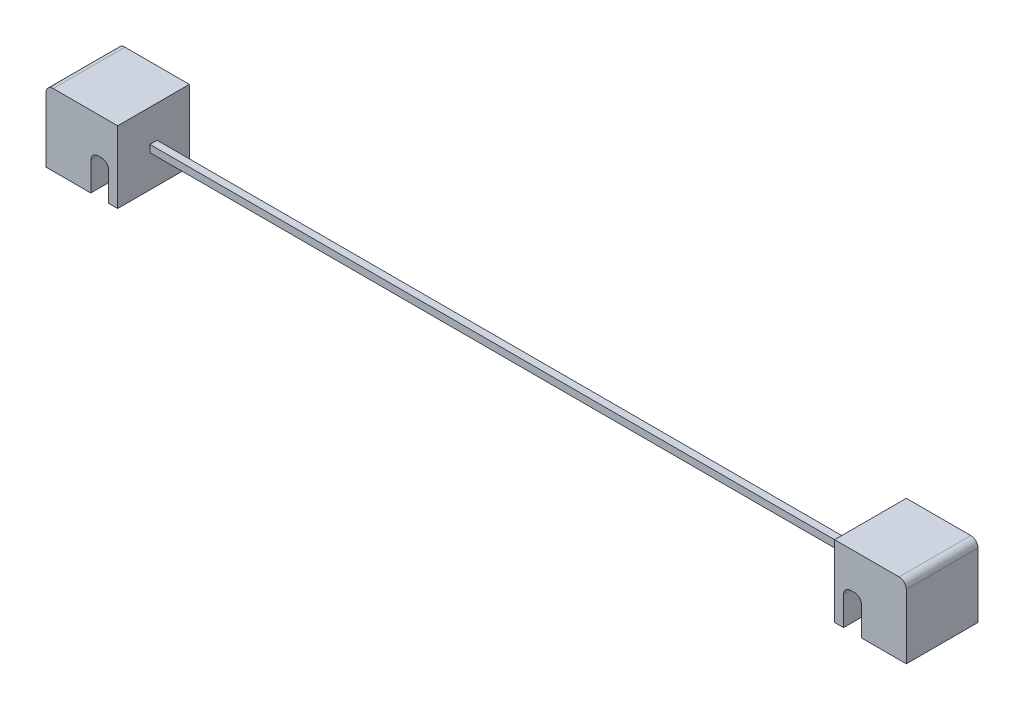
ISO-10303-21;
HEADER;
FILE_DESCRIPTION(('STEP AP214'),'2;1');
FILE_NAME('part.step','',(''),(''),'','','');
FILE_SCHEMA(('AUTOMOTIVE_DESIGN { 1 0 10303 214 1 1 1 1 }'));
ENDSEC;
DATA;
#1=APPLICATION_CONTEXT('core data for automotive mechanical design processes');
#2=APPLICATION_PROTOCOL_DEFINITION('international standard','automotive_design',2000,#1);
#3=PRODUCT_CONTEXT('',#1,'mechanical');
#4=PRODUCT('Part','Part','',(#3));
#5=PRODUCT_RELATED_PRODUCT_CATEGORY('part','',(#4));
#6=PRODUCT_DEFINITION_FORMATION('','',#4);
#7=PRODUCT_DEFINITION_CONTEXT('part definition',#1,'design');
#8=PRODUCT_DEFINITION('design','',#6,#7);
#9=PRODUCT_DEFINITION_SHAPE('','',#8);
#10=(LENGTH_UNIT() NAMED_UNIT(*) SI_UNIT(.MILLI.,.METRE.));
#11=(NAMED_UNIT(*) PLANE_ANGLE_UNIT() SI_UNIT($,.RADIAN.));
#12=(NAMED_UNIT(*) SI_UNIT($,.STERADIAN.) SOLID_ANGLE_UNIT());
#13=UNCERTAINTY_MEASURE_WITH_UNIT(LENGTH_MEASURE(1.E-05),#10,'distance_accuracy_value','');
#14=(GEOMETRIC_REPRESENTATION_CONTEXT(3) GLOBAL_UNCERTAINTY_ASSIGNED_CONTEXT((#13)) GLOBAL_UNIT_ASSIGNED_CONTEXT((#10,
#11,#12)) REPRESENTATION_CONTEXT('',''));
#15=CARTESIAN_POINT('',(0.,0.,0.));
#16=DIRECTION('',(0.,0.,1.));
#17=DIRECTION('',(1.,0.,0.));
#18=AXIS2_PLACEMENT_3D('',#15,#16,#17);
#19=CARTESIAN_POINT('',(-71.4285714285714,0.,142.857142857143));
#20=DIRECTION('',(-1.,0.,0.));
#21=DIRECTION('',(0.,0.,1.));
#22=AXIS2_PLACEMENT_3D('',#19,#20,#21);
#23=PLANE('',#22);
#24=DIRECTION('',(0.,1.,0.));
#25=VECTOR('',#24,1.);
#26=CARTESIAN_POINT('',(-71.4285714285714,0.,0.));
#27=LINE('',#26,#25);
#28=CARTESIAN_POINT('',(-71.4285714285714,-71.4285714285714,0.));
#29=VERTEX_POINT('',#28);
#30=CARTESIAN_POINT('',(-71.4285714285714,71.4285714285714,0.));
#31=VERTEX_POINT('',#30);
#32=EDGE_CURVE('E207',#29,#31,#27,.T.);
#33=ORIENTED_EDGE('',*,*,#32,.F.);
#34=DIRECTION('',(0.,0.,-1.));
#35=VECTOR('',#34,1.);
#36=CARTESIAN_POINT('',(-71.4285714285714,-71.4285714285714,142.857142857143));
#37=LINE('',#36,#35);
#38=CARTESIAN_POINT('',(-71.4285714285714,-71.4285714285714,142.857142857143));
#39=VERTEX_POINT('',#38);
#40=EDGE_CURVE('E165',#39,#29,#37,.T.);
#41=ORIENTED_EDGE('',*,*,#40,.F.);
#42=DIRECTION('',(0.,1.,0.));
#43=VECTOR('',#42,1.);
#44=CARTESIAN_POINT('',(-71.4285714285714,0.,142.857142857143));
#45=LINE('',#44,#43);
#46=CARTESIAN_POINT('',(-71.4285714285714,71.4285714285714,142.857142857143));
#47=VERTEX_POINT('',#46);
#48=EDGE_CURVE('E147',#39,#47,#45,.T.);
#49=ORIENTED_EDGE('',*,*,#48,.T.);
#50=DIRECTION('',(0.,0.,-1.));
#51=VECTOR('',#50,1.);
#52=CARTESIAN_POINT('',(-71.4285714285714,71.4285714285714,142.857142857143));
#53=LINE('',#52,#51);
#54=EDGE_CURVE('E156',#47,#31,#53,.T.);
#55=ORIENTED_EDGE('',*,*,#54,.T.);
#56=EDGE_LOOP('',(#33,#41,#49,#55));
#57=FACE_BOUND('',#56,.T.);
#58=DIRECTION('',(0.,0.,1.));
#59=VECTOR('',#58,1.);
#60=CARTESIAN_POINT('',(-71.4285714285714,-7.14285714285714,78.5714285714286));
#61=LINE('',#60,#59);
#62=CARTESIAN_POINT('',(-71.4285714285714,-7.14285714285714,64.2857142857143));
#63=VERTEX_POINT('',#62);
#64=CARTESIAN_POINT('',(-71.4285714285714,-7.14285714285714,78.5714285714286));
#65=VERTEX_POINT('',#64);
#66=EDGE_CURVE('E303',#63,#65,#61,.T.);
#67=ORIENTED_EDGE('',*,*,#66,.F.);
#68=DIRECTION('',(0.,-1.,0.));
#69=VECTOR('',#68,1.);
#70=CARTESIAN_POINT('',(-71.4285714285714,-7.14285714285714,64.2857142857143));
#71=LINE('',#70,#69);
#72=CARTESIAN_POINT('',(-71.4285714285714,7.14285714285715,64.2857142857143));
#73=VERTEX_POINT('',#72);
#74=EDGE_CURVE('E307',#73,#63,#71,.T.);
#75=ORIENTED_EDGE('',*,*,#74,.F.);
#76=DIRECTION('',(0.,0.,-1.));
#77=VECTOR('',#76,1.);
#78=CARTESIAN_POINT('',(-71.4285714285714,7.14285714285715,78.5714285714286));
#79=LINE('',#78,#77);
#80=CARTESIAN_POINT('',(-71.4285714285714,7.14285714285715,78.5714285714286));
#81=VERTEX_POINT('',#80);
#82=EDGE_CURVE('E296',#81,#73,#79,.T.);
#83=ORIENTED_EDGE('',*,*,#82,.F.);
#84=DIRECTION('',(0.,1.,0.));
#85=VECTOR('',#84,1.);
#86=CARTESIAN_POINT('',(-71.4285714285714,-7.14285714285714,78.5714285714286));
#87=LINE('',#86,#85);
#88=EDGE_CURVE('E300',#65,#81,#87,.T.);
#89=ORIENTED_EDGE('',*,*,#88,.F.);
#90=EDGE_LOOP('',(#67,#75,#83,#89));
#91=FACE_BOUND('',#90,.T.);
#92=ADVANCED_FACE('F41',(#57,#91),#23,.T.);
#93=CARTESIAN_POINT('',(-53.5714285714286,0.,142.857142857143));
#94=DIRECTION('',(-1.,0.,0.));
#95=DIRECTION('',(0.,-1.,0.));
#96=AXIS2_PLACEMENT_3D('',#93,#94,#95);
#97=PLANE('',#96);
#98=DIRECTION('',(0.,1.,0.));
#99=VECTOR('',#98,1.);
#100=CARTESIAN_POINT('',(-53.5714285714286,0.,0.));
#101=LINE('',#100,#99);
#102=CARTESIAN_POINT('',(-53.5714285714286,-71.4285714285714,0.));
#103=VERTEX_POINT('',#102);
#104=CARTESIAN_POINT('',(-53.5714285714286,-14.2857142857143,0.));
#105=VERTEX_POINT('',#104);
#106=EDGE_CURVE('E176',#103,#105,#101,.T.);
#107=ORIENTED_EDGE('',*,*,#106,.T.);
#108=DIRECTION('',(0.,0.,-1.));
#109=VECTOR('',#108,1.);
#110=CARTESIAN_POINT('',(-53.5714285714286,-14.2857142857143,142.857142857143));
#111=LINE('',#110,#109);
#112=CARTESIAN_POINT('',(-53.5714285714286,-14.2857142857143,142.857142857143));
#113=VERTEX_POINT('',#112);
#114=EDGE_CURVE('E11',#113,#105,#111,.T.);
#115=ORIENTED_EDGE('',*,*,#114,.F.);
#116=DIRECTION('',(0.,1.,0.));
#117=VECTOR('',#116,1.);
#118=CARTESIAN_POINT('',(-53.5714285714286,0.,142.857142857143));
#119=LINE('',#118,#117);
#120=CARTESIAN_POINT('',(-53.5714285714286,-71.4285714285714,142.857142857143));
#121=VERTEX_POINT('',#120);
#122=EDGE_CURVE('E276',#121,#113,#119,.T.);
#123=ORIENTED_EDGE('',*,*,#122,.F.);
#124=DIRECTION('',(0.,0.,-1.));
#125=VECTOR('',#124,1.);
#126=CARTESIAN_POINT('',(-53.5714285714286,-71.4285714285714,142.857142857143));
#127=LINE('',#126,#125);
#128=EDGE_CURVE('E66',#121,#103,#127,.T.);
#129=ORIENTED_EDGE('',*,*,#128,.T.);
#130=EDGE_LOOP('',(#107,#115,#123,#129));
#131=FACE_BOUND('',#130,.T.);
#132=ADVANCED_FACE('F43',(#131),#97,.F.);
#133=CARTESIAN_POINT('',(-39.2857142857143,-14.2857142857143,142.857142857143));
#134=DIRECTION('',(0.,0.,-1.));
#135=DIRECTION('',(-1.,0.,0.));
#136=AXIS2_PLACEMENT_3D('',#133,#134,#135);
#137=CYLINDRICAL_SURFACE('',#136,14.2857142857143);
#138=CARTESIAN_POINT('',(-39.2857142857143,-14.2857142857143,0.));
#139=DIRECTION('',(0.,0.,1.));
#140=DIRECTION('',(1.,0.,0.));
#141=AXIS2_PLACEMENT_3D('',#138,#139,#140);
#142=CIRCLE('',#141,14.2857142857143);
#143=CARTESIAN_POINT('',(-39.2857142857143,0.,0.));
#144=VERTEX_POINT('',#143);
#145=EDGE_CURVE('E179',#105,#144,#142,.F.);
#146=ORIENTED_EDGE('',*,*,#145,.T.);
#147=DIRECTION('',(0.,0.,-1.));
#148=VECTOR('',#147,1.);
#149=CARTESIAN_POINT('',(-39.2857142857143,0.,142.857142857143));
#150=LINE('',#149,#148);
#151=CARTESIAN_POINT('',(-39.2857142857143,0.,142.857142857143));
#152=VERTEX_POINT('',#151);
#153=EDGE_CURVE('E50',#152,#144,#150,.T.);
#154=ORIENTED_EDGE('',*,*,#153,.F.);
#155=CARTESIAN_POINT('',(-39.2857142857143,-14.2857142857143,142.857142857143));
#156=DIRECTION('',(0.,0.,1.));
#157=DIRECTION('',(1.,0.,0.));
#158=AXIS2_PLACEMENT_3D('',#155,#156,#157);
#159=CIRCLE('',#158,14.2857142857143);
#160=EDGE_CURVE('E114',#113,#152,#159,.F.);
#161=ORIENTED_EDGE('',*,*,#160,.F.);
#162=ORIENTED_EDGE('',*,*,#114,.T.);
#163=EDGE_LOOP('',(#146,#154,#161,#162));
#164=FACE_BOUND('',#163,.T.);
#165=ADVANCED_FACE('F546',(#164),#137,.F.);
#166=CARTESIAN_POINT('',(0.,0.,142.857142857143));
#167=DIRECTION('',(0.,1.,0.));
#168=DIRECTION('',(-1.,0.,0.));
#169=AXIS2_PLACEMENT_3D('',#166,#167,#168);
#170=PLANE('',#169);
#171=DIRECTION('',(1.,0.,0.));
#172=VECTOR('',#171,1.);
#173=CARTESIAN_POINT('',(0.,0.,0.));
#174=LINE('',#173,#172);
#175=CARTESIAN_POINT('',(-32.1428571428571,0.,0.));
#176=VERTEX_POINT('',#175);
#177=EDGE_CURVE('E183',#144,#176,#174,.T.);
#178=ORIENTED_EDGE('',*,*,#177,.T.);
#179=DIRECTION('',(0.,0.,-1.));
#180=VECTOR('',#179,1.);
#181=CARTESIAN_POINT('',(-32.1428571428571,0.,142.857142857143));
#182=LINE('',#181,#180);
#183=CARTESIAN_POINT('',(-32.1428571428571,0.,142.857142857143));
#184=VERTEX_POINT('',#183);
#185=EDGE_CURVE('E229',#184,#176,#182,.T.);
#186=ORIENTED_EDGE('',*,*,#185,.F.);
#187=DIRECTION('',(1.,0.,0.));
#188=VECTOR('',#187,1.);
#189=CARTESIAN_POINT('',(0.,0.,142.857142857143));
#190=LINE('',#189,#188);
#191=EDGE_CURVE('E239',#152,#184,#190,.T.);
#192=ORIENTED_EDGE('',*,*,#191,.F.);
#193=ORIENTED_EDGE('',*,*,#153,.T.);
#194=EDGE_LOOP('',(#178,#186,#192,#193));
#195=FACE_BOUND('',#194,.T.);
#196=ADVANCED_FACE('F237',(#195),#170,.F.);
#197=CARTESIAN_POINT('',(-32.1428571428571,-14.2857142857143,142.857142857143));
#198=DIRECTION('',(0.,0.,-1.));
#199=DIRECTION('',(-1.,0.,0.));
#200=AXIS2_PLACEMENT_3D('',#197,#198,#199);
#201=CYLINDRICAL_SURFACE('',#200,14.2857142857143);
#202=CARTESIAN_POINT('',(-32.1428571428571,-14.2857142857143,0.));
#203=DIRECTION('',(0.,0.,1.));
#204=DIRECTION('',(1.,0.,0.));
#205=AXIS2_PLACEMENT_3D('',#202,#203,#204);
#206=CIRCLE('',#205,14.2857142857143);
#207=CARTESIAN_POINT('',(-17.8571428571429,-14.2857142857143,0.));
#208=VERTEX_POINT('',#207);
#209=EDGE_CURVE('E186',#176,#208,#206,.F.);
#210=ORIENTED_EDGE('',*,*,#209,.T.);
#211=DIRECTION('',(0.,0.,-1.));
#212=VECTOR('',#211,1.);
#213=CARTESIAN_POINT('',(-17.8571428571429,-14.2857142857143,142.857142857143));
#214=LINE('',#213,#212);
#215=CARTESIAN_POINT('',(-17.8571428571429,-14.2857142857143,142.857142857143));
#216=VERTEX_POINT('',#215);
#217=EDGE_CURVE('E226',#216,#208,#214,.T.);
#218=ORIENTED_EDGE('',*,*,#217,.F.);
#219=CARTESIAN_POINT('',(-32.1428571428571,-14.2857142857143,142.857142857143));
#220=DIRECTION('',(0.,0.,1.));
#221=DIRECTION('',(1.,0.,0.));
#222=AXIS2_PLACEMENT_3D('',#219,#220,#221);
#223=CIRCLE('',#222,14.2857142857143);
#224=EDGE_CURVE('E249',#184,#216,#223,.F.);
#225=ORIENTED_EDGE('',*,*,#224,.F.);
#226=ORIENTED_EDGE('',*,*,#185,.T.);
#227=EDGE_LOOP('',(#210,#218,#225,#226));
#228=FACE_BOUND('',#227,.T.);
#229=ADVANCED_FACE('F246',(#228),#201,.F.);
#230=CARTESIAN_POINT('',(-17.8571428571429,0.,142.857142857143));
#231=DIRECTION('',(-1.,0.,0.));
#232=DIRECTION('',(0.,0.,1.));
#233=AXIS2_PLACEMENT_3D('',#230,#231,#232);
#234=PLANE('',#233);
#235=DIRECTION('',(0.,1.,0.));
#236=VECTOR('',#235,1.);
#237=CARTESIAN_POINT('',(-17.8571428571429,0.,0.));
#238=LINE('',#237,#236);
#239=CARTESIAN_POINT('',(-17.8571428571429,-71.4285714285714,0.));
#240=VERTEX_POINT('',#239);
#241=EDGE_CURVE('E190',#240,#208,#238,.T.);
#242=ORIENTED_EDGE('',*,*,#241,.F.);
#243=DIRECTION('',(0.,0.,-1.));
#244=VECTOR('',#243,1.);
#245=CARTESIAN_POINT('',(-17.8571428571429,-71.4285714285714,142.857142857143));
#246=LINE('',#245,#244);
#247=CARTESIAN_POINT('',(-17.8571428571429,-71.4285714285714,142.857142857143));
#248=VERTEX_POINT('',#247);
#249=EDGE_CURVE('E223',#248,#240,#246,.T.);
#250=ORIENTED_EDGE('',*,*,#249,.F.);
#251=DIRECTION('',(0.,1.,0.));
#252=VECTOR('',#251,1.);
#253=CARTESIAN_POINT('',(-17.8571428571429,0.,142.857142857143));
#254=LINE('',#253,#252);
#255=EDGE_CURVE('E252',#248,#216,#254,.T.);
#256=ORIENTED_EDGE('',*,*,#255,.T.);
#257=ORIENTED_EDGE('',*,*,#217,.T.);
#258=EDGE_LOOP('',(#242,#250,#256,#257));
#259=FACE_BOUND('',#258,.T.);
#260=ADVANCED_FACE('F558',(#259),#234,.T.);
#261=CARTESIAN_POINT('',(0.,-71.4285714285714,142.857142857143));
#262=DIRECTION('',(0.,-1.,0.));
#263=DIRECTION('',(1.,0.,0.));
#264=AXIS2_PLACEMENT_3D('',#261,#262,#263);
#265=PLANE('',#264);
#266=DIRECTION('',(-1.,0.,0.));
#267=VECTOR('',#266,1.);
#268=CARTESIAN_POINT('',(0.,-71.4285714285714,0.));
#269=LINE('',#268,#267);
#270=CARTESIAN_POINT('',(71.4285714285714,-71.4285714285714,0.));
#271=VERTEX_POINT('',#270);
#272=EDGE_CURVE('E194',#271,#240,#269,.T.);
#273=ORIENTED_EDGE('',*,*,#272,.F.);
#274=DIRECTION('',(0.,0.,-1.));
#275=VECTOR('',#274,1.);
#276=CARTESIAN_POINT('',(71.4285714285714,-71.4285714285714,142.857142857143));
#277=LINE('',#276,#275);
#278=CARTESIAN_POINT('',(71.4285714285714,-71.4285714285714,142.857142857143));
#279=VERTEX_POINT('',#278);
#280=EDGE_CURVE('E220',#279,#271,#277,.T.);
#281=ORIENTED_EDGE('',*,*,#280,.F.);
#282=DIRECTION('',(-1.,0.,0.));
#283=VECTOR('',#282,1.);
#284=CARTESIAN_POINT('',(0.,-71.4285714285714,142.857142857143));
#285=LINE('',#284,#283);
#286=EDGE_CURVE('E173',#279,#248,#285,.T.);
#287=ORIENTED_EDGE('',*,*,#286,.T.);
#288=ORIENTED_EDGE('',*,*,#249,.T.);
#289=EDGE_LOOP('',(#273,#281,#287,#288));
#290=FACE_BOUND('',#289,.T.);
#291=ADVANCED_FACE('F557',(#290),#265,.T.);
#292=CARTESIAN_POINT('',(71.4285714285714,0.,142.857142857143));
#293=DIRECTION('',(-1.,0.,0.));
#294=DIRECTION('',(0.,0.,1.));
#295=AXIS2_PLACEMENT_3D('',#292,#293,#294);
#296=PLANE('',#295);
#297=DIRECTION('',(0.,1.,0.));
#298=VECTOR('',#297,1.);
#299=CARTESIAN_POINT('',(71.4285714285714,0.,0.));
#300=LINE('',#299,#298);
#301=CARTESIAN_POINT('',(71.4285714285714,57.1428571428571,0.));
#302=VERTEX_POINT('',#301);
#303=EDGE_CURVE('E198',#271,#302,#300,.T.);
#304=ORIENTED_EDGE('',*,*,#303,.T.);
#305=DIRECTION('',(0.,0.,-1.));
#306=VECTOR('',#305,1.);
#307=CARTESIAN_POINT('',(71.4285714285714,57.1428571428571,142.857142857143));
#308=LINE('',#307,#306);
#309=CARTESIAN_POINT('',(71.4285714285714,57.1428571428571,142.857142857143));
#310=VERTEX_POINT('',#309);
#311=EDGE_CURVE('E216',#310,#302,#308,.T.);
#312=ORIENTED_EDGE('',*,*,#311,.F.);
#313=DIRECTION('',(0.,1.,0.));
#314=VECTOR('',#313,1.);
#315=CARTESIAN_POINT('',(71.4285714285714,0.,142.857142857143));
#316=LINE('',#315,#314);
#317=EDGE_CURVE('E262',#279,#310,#316,.T.);
#318=ORIENTED_EDGE('',*,*,#317,.F.);
#319=ORIENTED_EDGE('',*,*,#280,.T.);
#320=EDGE_LOOP('',(#304,#312,#318,#319));
#321=FACE_BOUND('',#320,.T.);
#322=ADVANCED_FACE('F269',(#321),#296,.F.);
#323=CARTESIAN_POINT('',(57.1428571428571,57.1428571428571,142.857142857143));
#324=DIRECTION('',(0.,0.,-1.));
#325=DIRECTION('',(-1.,0.,0.));
#326=AXIS2_PLACEMENT_3D('',#323,#324,#325);
#327=CYLINDRICAL_SURFACE('',#326,14.2857142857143);
#328=CARTESIAN_POINT('',(57.1428571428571,57.1428571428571,0.));
#329=DIRECTION('',(0.,0.,1.));
#330=DIRECTION('',(1.,0.,0.));
#331=AXIS2_PLACEMENT_3D('',#328,#329,#330);
#332=CIRCLE('',#331,14.2857142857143);
#333=CARTESIAN_POINT('',(57.1428571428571,71.4285714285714,0.));
#334=VERTEX_POINT('',#333);
#335=EDGE_CURVE('E202',#302,#334,#332,.T.);
#336=ORIENTED_EDGE('',*,*,#335,.T.);
#337=DIRECTION('',(0.,0.,-1.));
#338=VECTOR('',#337,1.);
#339=CARTESIAN_POINT('',(57.1428571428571,71.4285714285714,142.857142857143));
#340=LINE('',#339,#338);
#341=CARTESIAN_POINT('',(57.1428571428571,71.4285714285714,142.857142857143));
#342=VERTEX_POINT('',#341);
#343=EDGE_CURVE('E164',#342,#334,#340,.T.);
#344=ORIENTED_EDGE('',*,*,#343,.F.);
#345=CARTESIAN_POINT('',(57.1428571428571,57.1428571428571,142.857142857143));
#346=DIRECTION('',(0.,0.,1.));
#347=DIRECTION('',(1.,0.,0.));
#348=AXIS2_PLACEMENT_3D('',#345,#346,#347);
#349=CIRCLE('',#348,14.2857142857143);
#350=EDGE_CURVE('E149',#310,#342,#349,.T.);
#351=ORIENTED_EDGE('',*,*,#350,.F.);
#352=ORIENTED_EDGE('',*,*,#311,.T.);
#353=EDGE_LOOP('',(#336,#344,#351,#352));
#354=FACE_BOUND('',#353,.T.);
#355=ADVANCED_FACE('F273',(#354),#327,.T.);
#356=CARTESIAN_POINT('',(0.,71.4285714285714,142.857142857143));
#357=DIRECTION('',(0.,-1.,0.));
#358=DIRECTION('',(1.,0.,0.));
#359=AXIS2_PLACEMENT_3D('',#356,#357,#358);
#360=PLANE('',#359);
#361=DIRECTION('',(-1.,0.,0.));
#362=VECTOR('',#361,1.);
#363=CARTESIAN_POINT('',(0.,71.4285714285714,0.));
#364=LINE('',#363,#362);
#365=EDGE_CURVE('E159',#334,#31,#364,.T.);
#366=ORIENTED_EDGE('',*,*,#365,.T.);
#367=ORIENTED_EDGE('',*,*,#54,.F.);
#368=DIRECTION('',(-1.,0.,0.));
#369=VECTOR('',#368,1.);
#370=CARTESIAN_POINT('',(0.,71.4285714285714,142.857142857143));
#371=LINE('',#370,#369);
#372=EDGE_CURVE('E142',#342,#47,#371,.T.);
#373=ORIENTED_EDGE('',*,*,#372,.F.);
#374=ORIENTED_EDGE('',*,*,#343,.T.);
#375=EDGE_LOOP('',(#366,#367,#373,#374));
#376=FACE_BOUND('',#375,.T.);
#377=ADVANCED_FACE('F157',(#376),#360,.F.);
#378=EDGE_CURVE('E199',#103,#29,#269,.T.);
#379=ORIENTED_EDGE('',*,*,#378,.F.);
#380=ORIENTED_EDGE('',*,*,#128,.F.);
#381=EDGE_CURVE('E169',#121,#39,#285,.T.);
#382=ORIENTED_EDGE('',*,*,#381,.T.);
#383=ORIENTED_EDGE('',*,*,#40,.T.);
#384=EDGE_LOOP('',(#379,#380,#382,#383));
#385=FACE_BOUND('',#384,.T.);
#386=ADVANCED_FACE('F549',(#385),#265,.T.);
#387=CARTESIAN_POINT('',(0.,0.,142.857142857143));
#388=DIRECTION('',(0.,0.,1.));
#389=DIRECTION('',(1.,0.,0.));
#390=AXIS2_PLACEMENT_3D('',#387,#388,#389);
#391=PLANE('',#390);
#392=ORIENTED_EDGE('',*,*,#122,.T.);
#393=ORIENTED_EDGE('',*,*,#160,.T.);
#394=ORIENTED_EDGE('',*,*,#191,.T.);
#395=ORIENTED_EDGE('',*,*,#224,.T.);
#396=ORIENTED_EDGE('',*,*,#255,.F.);
#397=ORIENTED_EDGE('',*,*,#286,.F.);
#398=ORIENTED_EDGE('',*,*,#317,.T.);
#399=ORIENTED_EDGE('',*,*,#350,.T.);
#400=ORIENTED_EDGE('',*,*,#372,.T.);
#401=ORIENTED_EDGE('',*,*,#48,.F.);
#402=ORIENTED_EDGE('',*,*,#381,.F.);
#403=EDGE_LOOP('',(#392,#393,#394,#395,#396,#397,#398,#399,#400,#401,#402));
#404=FACE_BOUND('',#403,.T.);
#405=ADVANCED_FACE('F144',(#404),#391,.T.);
#406=CARTESIAN_POINT('',(0.,0.,0.));
#407=DIRECTION('',(0.,0.,1.));
#408=DIRECTION('',(1.,0.,0.));
#409=AXIS2_PLACEMENT_3D('',#406,#407,#408);
#410=PLANE('',#409);
#411=ORIENTED_EDGE('',*,*,#106,.F.);
#412=ORIENTED_EDGE('',*,*,#378,.T.);
#413=ORIENTED_EDGE('',*,*,#32,.T.);
#414=ORIENTED_EDGE('',*,*,#365,.F.);
#415=ORIENTED_EDGE('',*,*,#335,.F.);
#416=ORIENTED_EDGE('',*,*,#303,.F.);
#417=ORIENTED_EDGE('',*,*,#272,.T.);
#418=ORIENTED_EDGE('',*,*,#241,.T.);
#419=ORIENTED_EDGE('',*,*,#209,.F.);
#420=ORIENTED_EDGE('',*,*,#177,.F.);
#421=ORIENTED_EDGE('',*,*,#145,.F.);
#422=EDGE_LOOP('',(#411,#412,#413,#414,#415,#416,#417,#418,#419,#420,#421));
#423=FACE_BOUND('',#422,.T.);
#424=ADVANCED_FACE('F242',(#423),#410,.F.);
#425=CARTESIAN_POINT('',(-1500.,-7.14285714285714,64.2857142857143));
#426=DIRECTION('',(0.,0.,1.));
#427=DIRECTION('',(1.,0.,0.));
#428=AXIS2_PLACEMENT_3D('',#425,#426,#427);
#429=PLANE('',#428);
#430=ORIENTED_EDGE('',*,*,#74,.T.);
#431=DIRECTION('',(1.,0.,0.));
#432=VECTOR('',#431,1.);
#433=CARTESIAN_POINT('',(-1500.,-7.14285714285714,64.2857142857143));
#434=LINE('',#433,#432);
#435=CARTESIAN_POINT('',(-1500.,-7.14285714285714,64.2857142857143));
#436=VERTEX_POINT('',#435);
#437=EDGE_CURVE('E180',#436,#63,#434,.T.);
#438=ORIENTED_EDGE('',*,*,#437,.F.);
#439=DIRECTION('',(0.,-1.,0.));
#440=VECTOR('',#439,1.);
#441=CARTESIAN_POINT('',(-1500.,-7.14285714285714,64.2857142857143));
#442=LINE('',#441,#440);
#443=CARTESIAN_POINT('',(-1500.,7.14285714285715,64.2857142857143));
#444=VERTEX_POINT('',#443);
#445=EDGE_CURVE('E299',#444,#436,#442,.T.);
#446=ORIENTED_EDGE('',*,*,#445,.F.);
#447=DIRECTION('',(1.,0.,0.));
#448=VECTOR('',#447,1.);
#449=CARTESIAN_POINT('',(-1500.,7.14285714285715,64.2857142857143));
#450=LINE('',#449,#448);
#451=EDGE_CURVE('E291',#444,#73,#450,.T.);
#452=ORIENTED_EDGE('',*,*,#451,.T.);
#453=EDGE_LOOP('',(#430,#438,#446,#452));
#454=FACE_BOUND('',#453,.T.);
#455=ADVANCED_FACE('F522',(#454),#429,.F.);
#456=CARTESIAN_POINT('',(-1500.,-7.14285714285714,78.5714285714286));
#457=DIRECTION('',(0.,1.,0.));
#458=DIRECTION('',(0.,0.,1.));
#459=AXIS2_PLACEMENT_3D('',#456,#457,#458);
#460=PLANE('',#459);
#461=ORIENTED_EDGE('',*,*,#66,.T.);
#462=DIRECTION('',(1.,0.,0.));
#463=VECTOR('',#462,1.);
#464=CARTESIAN_POINT('',(-1500.,-7.14285714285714,78.5714285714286));
#465=LINE('',#464,#463);
#466=CARTESIAN_POINT('',(-1500.,-7.14285714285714,78.5714285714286));
#467=VERTEX_POINT('',#466);
#468=EDGE_CURVE('E285',#467,#65,#465,.T.);
#469=ORIENTED_EDGE('',*,*,#468,.F.);
#470=DIRECTION('',(0.,0.,1.));
#471=VECTOR('',#470,1.);
#472=CARTESIAN_POINT('',(-1500.,-7.14285714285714,78.5714285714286));
#473=LINE('',#472,#471);
#474=EDGE_CURVE('E319',#436,#467,#473,.T.);
#475=ORIENTED_EDGE('',*,*,#474,.F.);
#476=ORIENTED_EDGE('',*,*,#437,.T.);
#477=EDGE_LOOP('',(#461,#469,#475,#476));
#478=FACE_BOUND('',#477,.T.);
#479=ADVANCED_FACE('F527',(#478),#460,.F.);
#480=CARTESIAN_POINT('',(-1500.,-7.14285714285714,78.5714285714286));
#481=DIRECTION('',(0.,0.,-1.));
#482=DIRECTION('',(-1.,0.,0.));
#483=AXIS2_PLACEMENT_3D('',#480,#481,#482);
#484=PLANE('',#483);
#485=ORIENTED_EDGE('',*,*,#88,.T.);
#486=DIRECTION('',(1.,0.,0.));
#487=VECTOR('',#486,1.);
#488=CARTESIAN_POINT('',(-1500.,7.14285714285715,78.5714285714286));
#489=LINE('',#488,#487);
#490=CARTESIAN_POINT('',(-1500.,7.14285714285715,78.5714285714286));
#491=VERTEX_POINT('',#490);
#492=EDGE_CURVE('E57',#491,#81,#489,.T.);
#493=ORIENTED_EDGE('',*,*,#492,.F.);
#494=DIRECTION('',(0.,1.,0.));
#495=VECTOR('',#494,1.);
#496=CARTESIAN_POINT('',(-1500.,-7.14285714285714,78.5714285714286));
#497=LINE('',#496,#495);
#498=EDGE_CURVE('E315',#467,#491,#497,.T.);
#499=ORIENTED_EDGE('',*,*,#498,.F.);
#500=ORIENTED_EDGE('',*,*,#468,.T.);
#501=EDGE_LOOP('',(#485,#493,#499,#500));
#502=FACE_BOUND('',#501,.T.);
#503=ADVANCED_FACE('F525',(#502),#484,.F.);
#504=CARTESIAN_POINT('',(-1500.,7.14285714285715,78.5714285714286));
#505=DIRECTION('',(0.,-1.,0.));
#506=DIRECTION('',(0.,0.,-1.));
#507=AXIS2_PLACEMENT_3D('',#504,#505,#506);
#508=PLANE('',#507);
#509=ORIENTED_EDGE('',*,*,#82,.T.);
#510=ORIENTED_EDGE('',*,*,#451,.F.);
#511=DIRECTION('',(0.,0.,-1.));
#512=VECTOR('',#511,1.);
#513=CARTESIAN_POINT('',(-1500.,7.14285714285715,78.5714285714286));
#514=LINE('',#513,#512);
#515=EDGE_CURVE('E295',#491,#444,#514,.T.);
#516=ORIENTED_EDGE('',*,*,#515,.F.);
#517=ORIENTED_EDGE('',*,*,#492,.T.);
#518=EDGE_LOOP('',(#509,#510,#516,#517));
#519=FACE_BOUND('',#518,.T.);
#520=ADVANCED_FACE('F518',(#519),#508,.F.);
#521=CARTESIAN_POINT('',(-1499.99999142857,0.,142.857142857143));
#522=DIRECTION('',(-1.,0.,0.));
#523=DIRECTION('',(0.,0.,1.));
#524=AXIS2_PLACEMENT_3D('',#521,#522,#523);
#525=PLANE('',#524);
#526=DIRECTION('',(0.,1.,0.));
#527=VECTOR('',#526,1.);
#528=CARTESIAN_POINT('',(-1499.99999142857,0.,0.));
#529=LINE('',#528,#527);
#530=CARTESIAN_POINT('',(-1499.99999142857,-71.4285714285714,0.));
#531=VERTEX_POINT('',#530);
#532=CARTESIAN_POINT('',(-1499.99999142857,71.4285714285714,0.));
#533=VERTEX_POINT('',#532);
#534=EDGE_CURVE('E400',#531,#533,#529,.T.);
#535=ORIENTED_EDGE('',*,*,#534,.T.);
#536=DIRECTION('',(0.,0.,-1.));
#537=VECTOR('',#536,1.);
#538=CARTESIAN_POINT('',(-1499.99999142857,71.4285714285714,142.857142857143));
#539=LINE('',#538,#537);
#540=CARTESIAN_POINT('',(-1499.99999142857,71.4285714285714,142.857142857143));
#541=VERTEX_POINT('',#540);
#542=EDGE_CURVE('E333',#541,#533,#539,.T.);
#543=ORIENTED_EDGE('',*,*,#542,.F.);
#544=DIRECTION('',(0.,1.,0.));
#545=VECTOR('',#544,1.);
#546=CARTESIAN_POINT('',(-1499.99999142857,0.,142.857142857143));
#547=LINE('',#546,#545);
#548=CARTESIAN_POINT('',(-1499.99999142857,-71.4285714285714,142.857142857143));
#549=VERTEX_POINT('',#548);
#550=EDGE_CURVE('E440',#549,#541,#547,.T.);
#551=ORIENTED_EDGE('',*,*,#550,.F.);
#552=DIRECTION('',(0.,0.,-1.));
#553=VECTOR('',#552,1.);
#554=CARTESIAN_POINT('',(-1499.99999142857,-71.4285714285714,142.857142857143));
#555=LINE('',#554,#553);
#556=EDGE_CURVE('E329',#549,#531,#555,.T.);
#557=ORIENTED_EDGE('',*,*,#556,.T.);
#558=EDGE_LOOP('',(#535,#543,#551,#557));
#559=FACE_BOUND('',#558,.T.);
#560=ORIENTED_EDGE('',*,*,#515,.T.);
#561=ORIENTED_EDGE('',*,*,#445,.T.);
#562=ORIENTED_EDGE('',*,*,#474,.T.);
#563=ORIENTED_EDGE('',*,*,#498,.T.);
#564=EDGE_LOOP('',(#560,#561,#562,#563));
#565=FACE_BOUND('',#564,.T.);
#566=ADVANCED_FACE('F529',(#559,#565),#525,.F.);
#567=CARTESIAN_POINT('',(-1517.85713428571,0.,142.857142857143));
#568=DIRECTION('',(-1.,0.,0.));
#569=DIRECTION('',(0.,-1.,0.));
#570=AXIS2_PLACEMENT_3D('',#567,#568,#569);
#571=PLANE('',#570);
#572=DIRECTION('',(0.,1.,0.));
#573=VECTOR('',#572,1.);
#574=CARTESIAN_POINT('',(-1517.85713428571,0.,0.));
#575=LINE('',#574,#573);
#576=CARTESIAN_POINT('',(-1517.85713428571,-71.4285714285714,0.));
#577=VERTEX_POINT('',#576);
#578=CARTESIAN_POINT('',(-1517.85713428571,-14.2857142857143,0.));
#579=VERTEX_POINT('',#578);
#580=EDGE_CURVE('E408',#577,#579,#575,.T.);
#581=ORIENTED_EDGE('',*,*,#580,.F.);
#582=DIRECTION('',(0.,0.,-1.));
#583=VECTOR('',#582,1.);
#584=CARTESIAN_POINT('',(-1517.85713428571,-71.4285714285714,142.857142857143));
#585=LINE('',#584,#583);
#586=CARTESIAN_POINT('',(-1517.85713428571,-71.4285714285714,142.857142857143));
#587=VERTEX_POINT('',#586);
#588=EDGE_CURVE('E311',#587,#577,#585,.T.);
#589=ORIENTED_EDGE('',*,*,#588,.F.);
#590=DIRECTION('',(0.,1.,0.));
#591=VECTOR('',#590,1.);
#592=CARTESIAN_POINT('',(-1517.85713428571,0.,142.857142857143));
#593=LINE('',#592,#591);
#594=CARTESIAN_POINT('',(-1517.85713428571,-14.2857142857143,142.857142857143));
#595=VERTEX_POINT('',#594);
#596=EDGE_CURVE('E374',#587,#595,#593,.T.);
#597=ORIENTED_EDGE('',*,*,#596,.T.);
#598=DIRECTION('',(0.,0.,-1.));
#599=VECTOR('',#598,1.);
#600=CARTESIAN_POINT('',(-1517.85713428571,-14.2857142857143,142.857142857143));
#601=LINE('',#600,#599);
#602=EDGE_CURVE('E365',#595,#579,#601,.T.);
#603=ORIENTED_EDGE('',*,*,#602,.T.);
#604=EDGE_LOOP('',(#581,#589,#597,#603));
#605=FACE_BOUND('',#604,.T.);
#606=ADVANCED_FACE('F456',(#605),#571,.T.);
#607=CARTESIAN_POINT('',(-1571.42856285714,-71.4285714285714,142.857142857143));
#608=DIRECTION('',(0.,1.,0.));
#609=DIRECTION('',(-1.,0.,0.));
#610=AXIS2_PLACEMENT_3D('',#607,#608,#609);
#611=PLANE('',#610);
#612=DIRECTION('',(1.,0.,0.));
#613=VECTOR('',#612,1.);
#614=CARTESIAN_POINT('',(-1571.42856285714,-71.4285714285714,0.));
#615=LINE('',#614,#613);
#616=EDGE_CURVE('E404',#577,#531,#615,.T.);
#617=ORIENTED_EDGE('',*,*,#616,.T.);
#618=ORIENTED_EDGE('',*,*,#556,.F.);
#619=DIRECTION('',(1.,0.,0.));
#620=VECTOR('',#619,1.);
#621=CARTESIAN_POINT('',(-1571.42856285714,-71.4285714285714,142.857142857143));
#622=LINE('',#621,#620);
#623=EDGE_CURVE('E444',#587,#549,#622,.T.);
#624=ORIENTED_EDGE('',*,*,#623,.F.);
#625=ORIENTED_EDGE('',*,*,#588,.T.);
#626=EDGE_LOOP('',(#617,#618,#624,#625));
#627=FACE_BOUND('',#626,.T.);
#628=ADVANCED_FACE('F537',(#627),#611,.F.);
#629=CARTESIAN_POINT('',(-1571.42856285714,71.4285714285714,142.857142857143));
#630=DIRECTION('',(0.,1.,0.));
#631=DIRECTION('',(-1.,0.,0.));
#632=AXIS2_PLACEMENT_3D('',#629,#630,#631);
#633=PLANE('',#632);
#634=DIRECTION('',(1.,0.,0.));
#635=VECTOR('',#634,1.);
#636=CARTESIAN_POINT('',(-1571.42856285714,71.4285714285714,0.));
#637=LINE('',#636,#635);
#638=CARTESIAN_POINT('',(-1628.57142,71.4285714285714,0.));
#639=VERTEX_POINT('',#638);
#640=EDGE_CURVE('E396',#639,#533,#637,.T.);
#641=ORIENTED_EDGE('',*,*,#640,.F.);
#642=DIRECTION('',(0.,0.,-1.));
#643=VECTOR('',#642,1.);
#644=CARTESIAN_POINT('',(-1628.57142,71.4285714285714,142.857142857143));
#645=LINE('',#644,#643);
#646=CARTESIAN_POINT('',(-1628.57142,71.4285714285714,142.857142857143));
#647=VERTEX_POINT('',#646);
#648=EDGE_CURVE('E337',#647,#639,#645,.T.);
#649=ORIENTED_EDGE('',*,*,#648,.F.);
#650=DIRECTION('',(1.,0.,0.));
#651=VECTOR('',#650,1.);
#652=CARTESIAN_POINT('',(-1571.42856285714,71.4285714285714,142.857142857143));
#653=LINE('',#652,#651);
#654=EDGE_CURVE('E436',#647,#541,#653,.T.);
#655=ORIENTED_EDGE('',*,*,#654,.T.);
#656=ORIENTED_EDGE('',*,*,#542,.T.);
#657=EDGE_LOOP('',(#641,#649,#655,#656));
#658=FACE_BOUND('',#657,.T.);
#659=ADVANCED_FACE('F662',(#658),#633,.T.);
#660=CARTESIAN_POINT('',(-1628.57142,57.1428571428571,142.857142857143));
#661=DIRECTION('',(0.,0.,-1.));
#662=DIRECTION('',(-1.,0.,0.));
#663=AXIS2_PLACEMENT_3D('',#660,#661,#662);
#664=CYLINDRICAL_SURFACE('',#663,14.2857142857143);
#665=CARTESIAN_POINT('',(-1628.57142,57.1428571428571,0.));
#666=DIRECTION('',(0.,0.,-1.));
#667=DIRECTION('',(-1.,0.,0.));
#668=AXIS2_PLACEMENT_3D('',#665,#666,#667);
#669=CIRCLE('',#668,14.2857142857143);
#670=CARTESIAN_POINT('',(-1642.85713428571,57.1428571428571,0.));
#671=VERTEX_POINT('',#670);
#672=EDGE_CURVE('E392',#671,#639,#669,.T.);
#673=ORIENTED_EDGE('',*,*,#672,.F.);
#674=DIRECTION('',(0.,0.,-1.));
#675=VECTOR('',#674,1.);
#676=CARTESIAN_POINT('',(-1642.85713428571,57.1428571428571,142.857142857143));
#677=LINE('',#676,#675);
#678=CARTESIAN_POINT('',(-1642.85713428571,57.1428571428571,142.857142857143));
#679=VERTEX_POINT('',#678);
#680=EDGE_CURVE('E341',#679,#671,#677,.T.);
#681=ORIENTED_EDGE('',*,*,#680,.F.);
#682=CARTESIAN_POINT('',(-1628.57142,57.1428571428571,142.857142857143));
#683=DIRECTION('',(0.,0.,-1.));
#684=DIRECTION('',(-1.,0.,0.));
#685=AXIS2_PLACEMENT_3D('',#682,#683,#684);
#686=CIRCLE('',#685,14.2857142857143);
#687=EDGE_CURVE('E432',#679,#647,#686,.T.);
#688=ORIENTED_EDGE('',*,*,#687,.T.);
#689=ORIENTED_EDGE('',*,*,#648,.T.);
#690=EDGE_LOOP('',(#673,#681,#688,#689));
#691=FACE_BOUND('',#690,.T.);
#692=ADVANCED_FACE('F673',(#691),#664,.T.);
#693=CARTESIAN_POINT('',(-1642.85713428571,0.,142.857142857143));
#694=DIRECTION('',(-1.,0.,0.));
#695=DIRECTION('',(0.,0.,1.));
#696=AXIS2_PLACEMENT_3D('',#693,#694,#695);
#697=PLANE('',#696);
#698=DIRECTION('',(0.,1.,0.));
#699=VECTOR('',#698,1.);
#700=CARTESIAN_POINT('',(-1642.85713428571,0.,0.));
#701=LINE('',#700,#699);
#702=CARTESIAN_POINT('',(-1642.85713428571,-71.4285714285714,0.));
#703=VERTEX_POINT('',#702);
#704=EDGE_CURVE('E388',#703,#671,#701,.T.);
#705=ORIENTED_EDGE('',*,*,#704,.F.);
#706=DIRECTION('',(0.,0.,-1.));
#707=VECTOR('',#706,1.);
#708=CARTESIAN_POINT('',(-1642.85713428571,-71.4285714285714,142.857142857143));
#709=LINE('',#708,#707);
#710=CARTESIAN_POINT('',(-1642.85713428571,-71.4285714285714,142.857142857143));
#711=VERTEX_POINT('',#710);
#712=EDGE_CURVE('E345',#711,#703,#709,.T.);
#713=ORIENTED_EDGE('',*,*,#712,.F.);
#714=DIRECTION('',(0.,1.,0.));
#715=VECTOR('',#714,1.);
#716=CARTESIAN_POINT('',(-1642.85713428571,0.,142.857142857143));
#717=LINE('',#716,#715);
#718=EDGE_CURVE('E428',#711,#679,#717,.T.);
#719=ORIENTED_EDGE('',*,*,#718,.T.);
#720=ORIENTED_EDGE('',*,*,#680,.T.);
#721=EDGE_LOOP('',(#705,#713,#719,#720));
#722=FACE_BOUND('',#721,.T.);
#723=ADVANCED_FACE('F682',(#722),#697,.T.);
#724=CARTESIAN_POINT('',(-1553.57142,-71.4285714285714,0.));
#725=VERTEX_POINT('',#724);
#726=EDGE_CURVE('E387',#703,#725,#615,.T.);
#727=ORIENTED_EDGE('',*,*,#726,.T.);
#728=DIRECTION('',(0.,0.,-1.));
#729=VECTOR('',#728,1.);
#730=CARTESIAN_POINT('',(-1553.57142,-71.4285714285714,142.857142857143));
#731=LINE('',#730,#729);
#732=CARTESIAN_POINT('',(-1553.57142,-71.4285714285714,142.857142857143));
#733=VERTEX_POINT('',#732);
#734=EDGE_CURVE('E349',#733,#725,#731,.T.);
#735=ORIENTED_EDGE('',*,*,#734,.F.);
#736=EDGE_CURVE('E427',#711,#733,#622,.T.);
#737=ORIENTED_EDGE('',*,*,#736,.F.);
#738=ORIENTED_EDGE('',*,*,#712,.T.);
#739=EDGE_LOOP('',(#727,#735,#737,#738));
#740=FACE_BOUND('',#739,.T.);
#741=ADVANCED_FACE('F665',(#740),#611,.F.);
#742=CARTESIAN_POINT('',(-1553.57142,0.,142.857142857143));
#743=DIRECTION('',(-1.,0.,0.));
#744=DIRECTION('',(0.,0.,1.));
#745=AXIS2_PLACEMENT_3D('',#742,#743,#744);
#746=PLANE('',#745);
#747=DIRECTION('',(0.,1.,0.));
#748=VECTOR('',#747,1.);
#749=CARTESIAN_POINT('',(-1553.57142,0.,0.));
#750=LINE('',#749,#748);
#751=CARTESIAN_POINT('',(-1553.57142,-14.2857142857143,0.));
#752=VERTEX_POINT('',#751);
#753=EDGE_CURVE('E383',#725,#752,#750,.T.);
#754=ORIENTED_EDGE('',*,*,#753,.T.);
#755=DIRECTION('',(0.,0.,-1.));
#756=VECTOR('',#755,1.);
#757=CARTESIAN_POINT('',(-1553.57142,-14.2857142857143,142.857142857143));
#758=LINE('',#757,#756);
#759=CARTESIAN_POINT('',(-1553.57142,-14.2857142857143,142.857142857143));
#760=VERTEX_POINT('',#759);
#761=EDGE_CURVE('E353',#760,#752,#758,.T.);
#762=ORIENTED_EDGE('',*,*,#761,.F.);
#763=DIRECTION('',(0.,1.,0.));
#764=VECTOR('',#763,1.);
#765=CARTESIAN_POINT('',(-1553.57142,0.,142.857142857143));
#766=LINE('',#765,#764);
#767=EDGE_CURVE('E423',#733,#760,#766,.T.);
#768=ORIENTED_EDGE('',*,*,#767,.F.);
#769=ORIENTED_EDGE('',*,*,#734,.T.);
#770=EDGE_LOOP('',(#754,#762,#768,#769));
#771=FACE_BOUND('',#770,.T.);
#772=ADVANCED_FACE('F701',(#771),#746,.F.);
#773=CARTESIAN_POINT('',(-1539.28570571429,-14.2857142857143,142.857142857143));
#774=DIRECTION('',(0.,0.,-1.));
#775=DIRECTION('',(-1.,0.,0.));
#776=AXIS2_PLACEMENT_3D('',#773,#774,#775);
#777=CYLINDRICAL_SURFACE('',#776,14.2857142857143);
#778=CARTESIAN_POINT('',(-1539.28570571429,-14.2857142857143,0.));
#779=DIRECTION('',(0.,0.,-1.));
#780=DIRECTION('',(-1.,0.,0.));
#781=AXIS2_PLACEMENT_3D('',#778,#779,#780);
#782=CIRCLE('',#781,14.2857142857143);
#783=CARTESIAN_POINT('',(-1539.28570571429,0.,0.));
#784=VERTEX_POINT('',#783);
#785=EDGE_CURVE('E379',#784,#752,#782,.F.);
#786=ORIENTED_EDGE('',*,*,#785,.F.);
#787=DIRECTION('',(0.,0.,-1.));
#788=VECTOR('',#787,1.);
#789=CARTESIAN_POINT('',(-1539.28570571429,0.,142.857142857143));
#790=LINE('',#789,#788);
#791=CARTESIAN_POINT('',(-1539.28570571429,0.,142.857142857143));
#792=VERTEX_POINT('',#791);
#793=EDGE_CURVE('E357',#792,#784,#790,.T.);
#794=ORIENTED_EDGE('',*,*,#793,.F.);
#795=CARTESIAN_POINT('',(-1539.28570571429,-14.2857142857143,142.857142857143));
#796=DIRECTION('',(0.,0.,-1.));
#797=DIRECTION('',(-1.,0.,0.));
#798=AXIS2_PLACEMENT_3D('',#795,#796,#797);
#799=CIRCLE('',#798,14.2857142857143);
#800=EDGE_CURVE('E419',#792,#760,#799,.F.);
#801=ORIENTED_EDGE('',*,*,#800,.T.);
#802=ORIENTED_EDGE('',*,*,#761,.T.);
#803=EDGE_LOOP('',(#786,#794,#801,#802));
#804=FACE_BOUND('',#803,.T.);
#805=ADVANCED_FACE('F710',(#804),#777,.F.);
#806=CARTESIAN_POINT('',(-1571.42856285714,0.,142.857142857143));
#807=DIRECTION('',(0.,-1.,0.));
#808=DIRECTION('',(1.,0.,0.));
#809=AXIS2_PLACEMENT_3D('',#806,#807,#808);
#810=PLANE('',#809);
#811=DIRECTION('',(-1.,0.,0.));
#812=VECTOR('',#811,1.);
#813=CARTESIAN_POINT('',(-1571.42856285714,0.,0.));
#814=LINE('',#813,#812);
#815=CARTESIAN_POINT('',(-1532.14284857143,0.,0.));
#816=VERTEX_POINT('',#815);
#817=EDGE_CURVE('E375',#816,#784,#814,.T.);
#818=ORIENTED_EDGE('',*,*,#817,.F.);
#819=DIRECTION('',(0.,0.,-1.));
#820=VECTOR('',#819,1.);
#821=CARTESIAN_POINT('',(-1532.14284857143,0.,142.857142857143));
#822=LINE('',#821,#820);
#823=CARTESIAN_POINT('',(-1532.14284857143,0.,142.857142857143));
#824=VERTEX_POINT('',#823);
#825=EDGE_CURVE('E361',#824,#816,#822,.T.);
#826=ORIENTED_EDGE('',*,*,#825,.F.);
#827=DIRECTION('',(-1.,0.,0.));
#828=VECTOR('',#827,1.);
#829=CARTESIAN_POINT('',(-1571.42856285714,0.,142.857142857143));
#830=LINE('',#829,#828);
#831=EDGE_CURVE('E415',#824,#792,#830,.T.);
#832=ORIENTED_EDGE('',*,*,#831,.T.);
#833=ORIENTED_EDGE('',*,*,#793,.T.);
#834=EDGE_LOOP('',(#818,#826,#832,#833));
#835=FACE_BOUND('',#834,.T.);
#836=ADVANCED_FACE('F720',(#835),#810,.T.);
#837=CARTESIAN_POINT('',(-1532.14284857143,-14.2857142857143,142.857142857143));
#838=DIRECTION('',(0.,0.,-1.));
#839=DIRECTION('',(-1.,0.,0.));
#840=AXIS2_PLACEMENT_3D('',#837,#838,#839);
#841=CYLINDRICAL_SURFACE('',#840,14.2857142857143);
#842=CARTESIAN_POINT('',(-1532.14284857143,-14.2857142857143,0.));
#843=DIRECTION('',(0.,0.,-1.));
#844=DIRECTION('',(-1.,0.,0.));
#845=AXIS2_PLACEMENT_3D('',#842,#843,#844);
#846=CIRCLE('',#845,14.2857142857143);
#847=EDGE_CURVE('E370',#579,#816,#846,.F.);
#848=ORIENTED_EDGE('',*,*,#847,.F.);
#849=ORIENTED_EDGE('',*,*,#602,.F.);
#850=CARTESIAN_POINT('',(-1532.14284857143,-14.2857142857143,142.857142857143));
#851=DIRECTION('',(0.,0.,-1.));
#852=DIRECTION('',(-1.,0.,0.));
#853=AXIS2_PLACEMENT_3D('',#850,#851,#852);
#854=CIRCLE('',#853,14.2857142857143);
#855=EDGE_CURVE('E369',#595,#824,#854,.F.);
#856=ORIENTED_EDGE('',*,*,#855,.T.);
#857=ORIENTED_EDGE('',*,*,#825,.T.);
#858=EDGE_LOOP('',(#848,#849,#856,#857));
#859=FACE_BOUND('',#858,.T.);
#860=ADVANCED_FACE('F470',(#859),#841,.F.);
#861=CARTESIAN_POINT('',(-1571.42856285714,0.,142.857142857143));
#862=DIRECTION('',(0.,0.,1.));
#863=DIRECTION('',(-1.,0.,0.));
#864=AXIS2_PLACEMENT_3D('',#861,#862,#863);
#865=PLANE('',#864);
#866=ORIENTED_EDGE('',*,*,#596,.F.);
#867=ORIENTED_EDGE('',*,*,#623,.T.);
#868=ORIENTED_EDGE('',*,*,#550,.T.);
#869=ORIENTED_EDGE('',*,*,#654,.F.);
#870=ORIENTED_EDGE('',*,*,#687,.F.);
#871=ORIENTED_EDGE('',*,*,#718,.F.);
#872=ORIENTED_EDGE('',*,*,#736,.T.);
#873=ORIENTED_EDGE('',*,*,#767,.T.);
#874=ORIENTED_EDGE('',*,*,#800,.F.);
#875=ORIENTED_EDGE('',*,*,#831,.F.);
#876=ORIENTED_EDGE('',*,*,#855,.F.);
#877=EDGE_LOOP('',(#866,#867,#868,#869,#870,#871,#872,#873,#874,#875,#876));
#878=FACE_BOUND('',#877,.T.);
#879=ADVANCED_FACE('F466',(#878),#865,.T.);
#880=CARTESIAN_POINT('',(-1571.42856285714,0.,0.));
#881=DIRECTION('',(0.,0.,1.));
#882=DIRECTION('',(-1.,0.,0.));
#883=AXIS2_PLACEMENT_3D('',#880,#881,#882);
#884=PLANE('',#883);
#885=ORIENTED_EDGE('',*,*,#580,.T.);
#886=ORIENTED_EDGE('',*,*,#847,.T.);
#887=ORIENTED_EDGE('',*,*,#817,.T.);
#888=ORIENTED_EDGE('',*,*,#785,.T.);
#889=ORIENTED_EDGE('',*,*,#753,.F.);
#890=ORIENTED_EDGE('',*,*,#726,.F.);
#891=ORIENTED_EDGE('',*,*,#704,.T.);
#892=ORIENTED_EDGE('',*,*,#672,.T.);
#893=ORIENTED_EDGE('',*,*,#640,.T.);
#894=ORIENTED_EDGE('',*,*,#534,.F.);
#895=ORIENTED_EDGE('',*,*,#616,.F.);
#896=EDGE_LOOP('',(#885,#886,#887,#888,#889,#890,#891,#892,#893,#894,#895));
#897=FACE_BOUND('',#896,.T.);
#898=ADVANCED_FACE('F746',(#897),#884,.F.);
#899=CLOSED_SHELL('',(#92,#132,#165,#196,#229,#260,#291,#322,#355,#377,#386,#405,#424,#455,#479,
#503,#520,#566,#606,#628,#659,#692,#723,#741,#772,#805,#836,#860,#879,#898));
#900=MANIFOLD_SOLID_BREP('B2',#899);
#901=ADVANCED_BREP_SHAPE_REPRESENTATION('',(#18,#900),#14);
#902=SHAPE_DEFINITION_REPRESENTATION(#9,#901);
ENDSEC;
END-ISO-10303-21;
